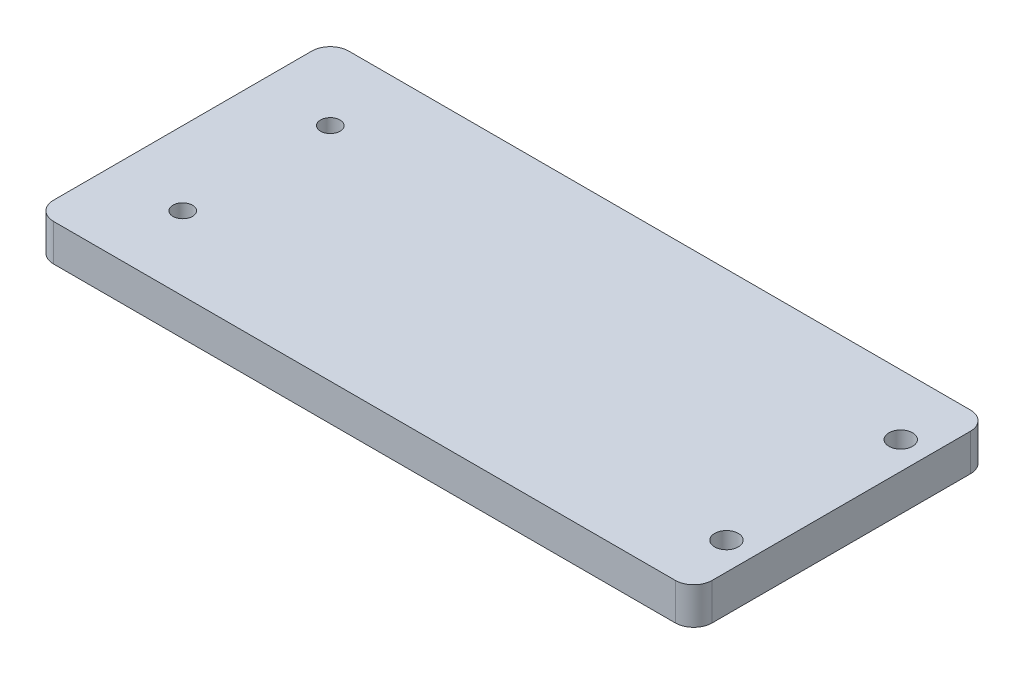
from build123d import *

# Parameters (mm, degrees)
SKETCH1_W           = 226.7204
SKETCH1_H           = 101.6
BOSS_EXTRUDE1_DEPTH = 12.7
SKETCH2_R           = 3.3655
SKETCH2_R_2         = 4.064
CUT_EXTRUDE1_DEPTH  = 249.768948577
FILLET1_R           = 6.35


with BuildPart() as part:
    # Sketch1 → Boss-Extrude1 (new body)
    with BuildSketch(Plane(origin=(0, 0, 0), x_dir=(1, 0, 0), z_dir=(0, 1, 0))):
        with Locations((113.3602, 50.8)):
            Rectangle(SKETCH1_W, SKETCH1_H)
    extrude(amount=-BOSS_EXTRUDE1_DEPTH)

    # Sketch2 → Cut-Extrude1 (cut, through all)
    with BuildSketch(Plane(origin=(0, 0, 0), x_dir=(1, 0, 0), z_dir=(0, 1, 0))):
        with Locations(Location((25.4, 76.2, 0), (0, 0, 270))):
            Circle(SKETCH2_R)
        with Locations(Location((25.4, 25.4, 0), (0, 0, 270))):
            Circle(SKETCH2_R)
        with Locations(Location((217.1954, 80.7974, 0), (0, 0, 270))):
            Circle(SKETCH2_R_2)
        with Locations(Location((217.1954, 20.8026, 0), (0, 0, 270))):
            Circle(SKETCH2_R_2)
    extrude(amount=-CUT_EXTRUDE1_DEPTH, mode=Mode.SUBTRACT)

    # Fillet1
    fillet1_edges = [part.edges().sort_by_distance(p)[0] for p in [
        (0, -6.35, -101.6),
        (226.7204, -6.35, -101.6),
        (226.7204, -6.35, 0),
        (0, -6.35, 0),
    ]]
    fillet(fillet1_edges, radius=FILLET1_R)


solid = part.part
